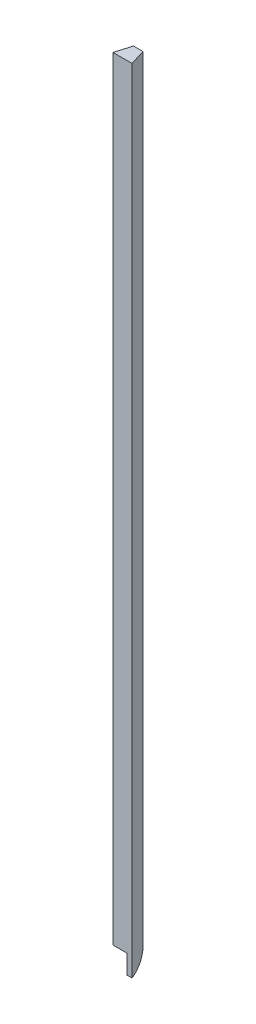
ISO-10303-21;
HEADER;
FILE_DESCRIPTION(('STEP AP214'),'2;1');
FILE_NAME('part.step','',(''),(''),'','','');
FILE_SCHEMA(('AUTOMOTIVE_DESIGN { 1 0 10303 214 1 1 1 1 }'));
ENDSEC;
DATA;
#1=APPLICATION_CONTEXT('core data for automotive mechanical design processes');
#2=APPLICATION_PROTOCOL_DEFINITION('international standard','automotive_design',2000,#1);
#3=PRODUCT_CONTEXT('',#1,'mechanical');
#4=PRODUCT('Part','Part','',(#3));
#5=PRODUCT_RELATED_PRODUCT_CATEGORY('part','',(#4));
#6=PRODUCT_DEFINITION_FORMATION('','',#4);
#7=PRODUCT_DEFINITION_CONTEXT('part definition',#1,'design');
#8=PRODUCT_DEFINITION('design','',#6,#7);
#9=PRODUCT_DEFINITION_SHAPE('','',#8);
#10=(LENGTH_UNIT() NAMED_UNIT(*) SI_UNIT(.MILLI.,.METRE.));
#11=(NAMED_UNIT(*) PLANE_ANGLE_UNIT() SI_UNIT($,.RADIAN.));
#12=(NAMED_UNIT(*) SI_UNIT($,.STERADIAN.) SOLID_ANGLE_UNIT());
#13=UNCERTAINTY_MEASURE_WITH_UNIT(LENGTH_MEASURE(1.E-05),#10,'distance_accuracy_value','');
#14=(GEOMETRIC_REPRESENTATION_CONTEXT(3) GLOBAL_UNCERTAINTY_ASSIGNED_CONTEXT((#13)) GLOBAL_UNIT_ASSIGNED_CONTEXT((#10,
#11,#12)) REPRESENTATION_CONTEXT('',''));
#15=CARTESIAN_POINT('',(0.,0.,0.));
#16=DIRECTION('',(0.,0.,1.));
#17=DIRECTION('',(1.,0.,0.));
#18=AXIS2_PLACEMENT_3D('',#15,#16,#17);
#19=CARTESIAN_POINT('',(-3.81,635.,-12.7));
#20=DIRECTION('',(0.957826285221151,0.,0.287347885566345));
#21=DIRECTION('',(0.287347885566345,0.,-0.957826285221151));
#22=AXIS2_PLACEMENT_3D('',#19,#20,#21);
#23=PLANE('',#22);
#24=DIRECTION('',(0.,-1.,0.));
#25=VECTOR('',#24,1.);
#26=CARTESIAN_POINT('',(-3.81,635.,-12.7));
#27=LINE('',#26,#25);
#28=CARTESIAN_POINT('',(-3.81,635.,-12.7));
#29=VERTEX_POINT('',#28);
#30=CARTESIAN_POINT('',(-3.81,15.24,-12.7));
#31=VERTEX_POINT('',#30);
#32=EDGE_CURVE('E131',#29,#31,#27,.T.);
#33=ORIENTED_EDGE('',*,*,#32,.T.);
#34=DIRECTION('',(0.287347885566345,0.,-0.957826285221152));
#35=VECTOR('',#34,1.);
#36=CARTESIAN_POINT('',(-7.62,15.24,0.));
#37=LINE('',#36,#35);
#38=CARTESIAN_POINT('',(-7.62,15.24,0.));
#39=VERTEX_POINT('',#38);
#40=EDGE_CURVE('E150',#39,#31,#37,.T.);
#41=ORIENTED_EDGE('',*,*,#40,.F.);
#42=DIRECTION('',(0.,-1.,0.));
#43=VECTOR('',#42,1.);
#44=CARTESIAN_POINT('',(-7.62,635.,0.));
#45=LINE('',#44,#43);
#46=CARTESIAN_POINT('',(-7.62,635.,0.));
#47=VERTEX_POINT('',#46);
#48=EDGE_CURVE('E11',#47,#39,#45,.T.);
#49=ORIENTED_EDGE('',*,*,#48,.F.);
#50=DIRECTION('',(-0.287347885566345,0.,0.957826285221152));
#51=VECTOR('',#50,1.);
#52=CARTESIAN_POINT('',(-3.81,635.,-12.7));
#53=LINE('',#52,#51);
#54=EDGE_CURVE('E125',#29,#47,#53,.T.);
#55=ORIENTED_EDGE('',*,*,#54,.F.);
#56=EDGE_LOOP('',(#33,#41,#49,#55));
#57=FACE_BOUND('',#56,.T.);
#58=ADVANCED_FACE('F39',(#57),#23,.F.);
#59=CARTESIAN_POINT('',(-7.62,635.,0.));
#60=DIRECTION('',(0.,0.,-1.));
#61=DIRECTION('',(-1.,0.,0.));
#62=AXIS2_PLACEMENT_3D('',#59,#60,#61);
#63=PLANE('',#62);
#64=DIRECTION('',(-1.,0.,0.));
#65=VECTOR('',#64,1.);
#66=CARTESIAN_POINT('',(3.81,15.24,0.));
#67=LINE('',#66,#65);
#68=CARTESIAN_POINT('',(3.81,15.24,0.));
#69=VERTEX_POINT('',#68);
#70=EDGE_CURVE('E109',#69,#39,#67,.T.);
#71=ORIENTED_EDGE('',*,*,#70,.F.);
#72=DIRECTION('',(0.,-1.,0.));
#73=VECTOR('',#72,1.);
#74=CARTESIAN_POINT('',(3.81,15.24,0.));
#75=LINE('',#74,#73);
#76=CARTESIAN_POINT('',(3.81,0.,0.));
#77=VERTEX_POINT('',#76);
#78=EDGE_CURVE('E116',#69,#77,#75,.T.);
#79=ORIENTED_EDGE('',*,*,#78,.T.);
#80=DIRECTION('',(1.,0.,0.));
#81=VECTOR('',#80,1.);
#82=CARTESIAN_POINT('',(-7.62,0.,0.));
#83=LINE('',#82,#81);
#84=CARTESIAN_POINT('',(7.62,0.,0.));
#85=VERTEX_POINT('',#84);
#86=EDGE_CURVE('E95',#77,#85,#83,.T.);
#87=ORIENTED_EDGE('',*,*,#86,.T.);
#88=DIRECTION('',(0.,-1.,0.));
#89=VECTOR('',#88,1.);
#90=CARTESIAN_POINT('',(7.62,635.,0.));
#91=LINE('',#90,#89);
#92=CARTESIAN_POINT('',(7.62,635.,0.));
#93=VERTEX_POINT('',#92);
#94=EDGE_CURVE('E46',#93,#85,#91,.T.);
#95=ORIENTED_EDGE('',*,*,#94,.F.);
#96=DIRECTION('',(1.,0.,0.));
#97=VECTOR('',#96,1.);
#98=CARTESIAN_POINT('',(-7.62,635.,0.));
#99=LINE('',#98,#97);
#100=EDGE_CURVE('E127',#47,#93,#99,.T.);
#101=ORIENTED_EDGE('',*,*,#100,.F.);
#102=ORIENTED_EDGE('',*,*,#48,.T.);
#103=EDGE_LOOP('',(#71,#79,#87,#95,#101,#102));
#104=FACE_BOUND('',#103,.T.);
#105=ADVANCED_FACE('F147',(#104),#63,.F.);
#106=CARTESIAN_POINT('',(7.62,635.,0.));
#107=DIRECTION('',(-0.957826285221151,0.,0.287347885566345));
#108=DIRECTION('',(0.287347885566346,0.,0.957826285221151));
#109=AXIS2_PLACEMENT_3D('',#106,#107,#108);
#110=PLANE('',#109);
#111=ORIENTED_EDGE('',*,*,#94,.T.);
#112=CARTESIAN_POINT('',(8.001,13.97,1.27000000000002));
#113=DIRECTION('',(-0.957826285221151,0.,0.287347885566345));
#114=DIRECTION('',(-0.287347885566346,0.,-0.957826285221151));
#115=AXIS2_PLACEMENT_3D('',#112,#113,#114);
#116=ELLIPSE('',#115,14.6452532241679,14.0276084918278);
#117=CARTESIAN_POINT('',(3.81,12.7000000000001,-12.7));
#118=VERTEX_POINT('',#117);
#119=EDGE_CURVE('E93',#85,#118,#116,.F.);
#120=ORIENTED_EDGE('',*,*,#119,.T.);
#121=DIRECTION('',(0.,-1.,0.));
#122=VECTOR('',#121,1.);
#123=CARTESIAN_POINT('',(3.81,15.24,-12.7));
#124=LINE('',#123,#122);
#125=CARTESIAN_POINT('',(3.81,15.24,-12.7));
#126=VERTEX_POINT('',#125);
#127=EDGE_CURVE('E105',#126,#118,#124,.T.);
#128=ORIENTED_EDGE('',*,*,#127,.F.);
#129=DIRECTION('',(0.,-1.,0.));
#130=VECTOR('',#129,1.);
#131=CARTESIAN_POINT('',(3.81,635.,-12.7));
#132=LINE('',#131,#130);
#133=CARTESIAN_POINT('',(3.81,635.,-12.7));
#134=VERTEX_POINT('',#133);
#135=EDGE_CURVE('E136',#134,#126,#132,.T.);
#136=ORIENTED_EDGE('',*,*,#135,.F.);
#137=DIRECTION('',(-0.287347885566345,0.,-0.957826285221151));
#138=VECTOR('',#137,1.);
#139=CARTESIAN_POINT('',(7.62,635.,0.));
#140=LINE('',#139,#138);
#141=EDGE_CURVE('E58',#93,#134,#140,.T.);
#142=ORIENTED_EDGE('',*,*,#141,.F.);
#143=EDGE_LOOP('',(#111,#120,#128,#136,#142));
#144=FACE_BOUND('',#143,.T.);
#145=ADVANCED_FACE('F104',(#144),#110,.F.);
#146=CARTESIAN_POINT('',(3.81,635.,-12.7));
#147=DIRECTION('',(0.,0.,1.));
#148=DIRECTION('',(1.,0.,0.));
#149=AXIS2_PLACEMENT_3D('',#146,#147,#148);
#150=PLANE('',#149);
#151=ORIENTED_EDGE('',*,*,#135,.T.);
#152=DIRECTION('',(1.,0.,0.));
#153=VECTOR('',#152,1.);
#154=CARTESIAN_POINT('',(-3.81,15.24,-12.7));
#155=LINE('',#154,#153);
#156=EDGE_CURVE('E122',#31,#126,#155,.T.);
#157=ORIENTED_EDGE('',*,*,#156,.F.);
#158=ORIENTED_EDGE('',*,*,#32,.F.);
#159=DIRECTION('',(-1.,0.,0.));
#160=VECTOR('',#159,1.);
#161=CARTESIAN_POINT('',(3.81,635.,-12.7));
#162=LINE('',#161,#160);
#163=EDGE_CURVE('E53',#134,#29,#162,.T.);
#164=ORIENTED_EDGE('',*,*,#163,.F.);
#165=EDGE_LOOP('',(#151,#157,#158,#164));
#166=FACE_BOUND('',#165,.T.);
#167=ADVANCED_FACE('F139',(#166),#150,.F.);
#168=CARTESIAN_POINT('',(0.,635.,0.));
#169=DIRECTION('',(0.,1.,0.));
#170=DIRECTION('',(0.,0.,1.));
#171=AXIS2_PLACEMENT_3D('',#168,#169,#170);
#172=PLANE('',#171);
#173=ORIENTED_EDGE('',*,*,#54,.T.);
#174=ORIENTED_EDGE('',*,*,#100,.T.);
#175=ORIENTED_EDGE('',*,*,#141,.T.);
#176=ORIENTED_EDGE('',*,*,#163,.T.);
#177=EDGE_LOOP('',(#173,#174,#175,#176));
#178=FACE_BOUND('',#177,.T.);
#179=ADVANCED_FACE('F144',(#178),#172,.T.);
#180=CARTESIAN_POINT('',(3.81,15.24,-12.7));
#181=DIRECTION('',(1.,0.,0.));
#182=DIRECTION('',(0.,0.,-1.));
#183=AXIS2_PLACEMENT_3D('',#180,#181,#182);
#184=PLANE('',#183);
#185=ORIENTED_EDGE('',*,*,#127,.T.);
#186=CARTESIAN_POINT('',(3.81,13.97,1.27000000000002));
#187=DIRECTION('',(1.,0.,0.));
#188=DIRECTION('',(0.,0.,1.));
#189=AXIS2_PLACEMENT_3D('',#186,#187,#188);
#190=CIRCLE('',#189,14.0276084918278);
#191=EDGE_CURVE('E90',#77,#118,#190,.T.);
#192=ORIENTED_EDGE('',*,*,#191,.F.);
#193=ORIENTED_EDGE('',*,*,#78,.F.);
#194=DIRECTION('',(0.,0.,1.));
#195=VECTOR('',#194,1.);
#196=CARTESIAN_POINT('',(3.81,15.24,-12.7));
#197=LINE('',#196,#195);
#198=EDGE_CURVE('E114',#126,#69,#197,.T.);
#199=ORIENTED_EDGE('',*,*,#198,.F.);
#200=EDGE_LOOP('',(#185,#192,#193,#199));
#201=FACE_BOUND('',#200,.T.);
#202=ADVANCED_FACE('F112',(#201),#184,.F.);
#203=CARTESIAN_POINT('',(0.,15.24,0.));
#204=DIRECTION('',(0.,1.,0.));
#205=DIRECTION('',(0.,0.,1.));
#206=AXIS2_PLACEMENT_3D('',#203,#204,#205);
#207=PLANE('',#206);
#208=ORIENTED_EDGE('',*,*,#70,.T.);
#209=ORIENTED_EDGE('',*,*,#40,.T.);
#210=ORIENTED_EDGE('',*,*,#156,.T.);
#211=ORIENTED_EDGE('',*,*,#198,.T.);
#212=EDGE_LOOP('',(#208,#209,#210,#211));
#213=FACE_BOUND('',#212,.T.);
#214=ADVANCED_FACE('F149',(#213),#207,.F.);
#215=CARTESIAN_POINT('',(19.05,13.97,1.27000000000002));
#216=DIRECTION('',(-1.,0.,0.));
#217=DIRECTION('',(0.,0.,1.));
#218=AXIS2_PLACEMENT_3D('',#215,#216,#217);
#219=CYLINDRICAL_SURFACE('',#218,14.0276084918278);
#220=ORIENTED_EDGE('',*,*,#86,.F.);
#221=ORIENTED_EDGE('',*,*,#191,.T.);
#222=ORIENTED_EDGE('',*,*,#119,.F.);
#223=EDGE_LOOP('',(#220,#221,#222));
#224=FACE_BOUND('',#223,.T.);
#225=ADVANCED_FACE('F92',(#224),#219,.T.);
#226=CLOSED_SHELL('',(#58,#105,#145,#167,#179,#202,#214,#225));
#227=MANIFOLD_SOLID_BREP('B2',#226);
#228=ADVANCED_BREP_SHAPE_REPRESENTATION('',(#18,#227),#14);
#229=SHAPE_DEFINITION_REPRESENTATION(#9,#228);
ENDSEC;
END-ISO-10303-21;
